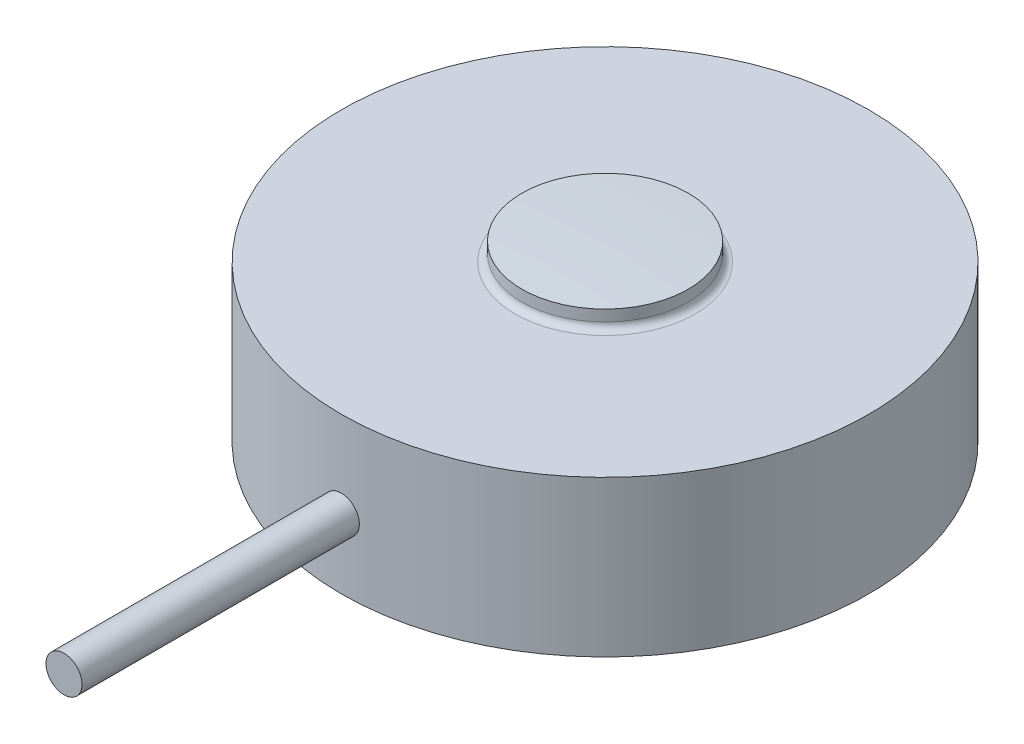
ISO-10303-21;
HEADER;
FILE_DESCRIPTION(('STEP AP214'),'2;1');
FILE_NAME('part.step','',(''),(''),'','','');
FILE_SCHEMA(('AUTOMOTIVE_DESIGN { 1 0 10303 214 1 1 1 1 }'));
ENDSEC;
DATA;
#1=APPLICATION_CONTEXT('core data for automotive mechanical design processes');
#2=APPLICATION_PROTOCOL_DEFINITION('international standard','automotive_design',2000,#1);
#3=PRODUCT_CONTEXT('',#1,'mechanical');
#4=PRODUCT('Part','Part','',(#3));
#5=PRODUCT_RELATED_PRODUCT_CATEGORY('part','',(#4));
#6=PRODUCT_DEFINITION_FORMATION('','',#4);
#7=PRODUCT_DEFINITION_CONTEXT('part definition',#1,'design');
#8=PRODUCT_DEFINITION('design','',#6,#7);
#9=PRODUCT_DEFINITION_SHAPE('','',#8);
#10=(LENGTH_UNIT() NAMED_UNIT(*) SI_UNIT(.MILLI.,.METRE.));
#11=(NAMED_UNIT(*) PLANE_ANGLE_UNIT() SI_UNIT($,.RADIAN.));
#12=(NAMED_UNIT(*) SI_UNIT($,.STERADIAN.) SOLID_ANGLE_UNIT());
#13=UNCERTAINTY_MEASURE_WITH_UNIT(LENGTH_MEASURE(1.E-05),#10,'distance_accuracy_value','');
#14=(GEOMETRIC_REPRESENTATION_CONTEXT(3) GLOBAL_UNCERTAINTY_ASSIGNED_CONTEXT((#13)) GLOBAL_UNIT_ASSIGNED_CONTEXT((#10,
#11,#12)) REPRESENTATION_CONTEXT('',''));
#15=CARTESIAN_POINT('',(0.,0.,0.));
#16=DIRECTION('',(0.,0.,1.));
#17=DIRECTION('',(1.,0.,0.));
#18=AXIS2_PLACEMENT_3D('',#15,#16,#17);
#19=CARTESIAN_POINT('',(0.,0.344999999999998,9.51));
#20=DIRECTION('',(0.,0.,1.));
#21=DIRECTION('',(1.,0.,0.));
#22=AXIS2_PLACEMENT_3D('',#19,#20,#21);
#23=PLANE('',#22);
#24=CARTESIAN_POINT('',(0.,-0.305000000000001,9.51));
#25=DIRECTION('',(0.,0.,1.));
#26=DIRECTION('',(1.,0.,0.));
#27=AXIS2_PLACEMENT_3D('',#24,#25,#26);
#28=CIRCLE('',#27,0.65);
#29=CARTESIAN_POINT('',(0.65,-0.305000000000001,9.51));
#30=VERTEX_POINT('',#29);
#31=EDGE_CURVE('E55',#30,#30,#28,.T.);
#32=ORIENTED_EDGE('',*,*,#31,.F.);
#33=EDGE_LOOP('',(#32));
#34=FACE_BOUND('',#33,.T.);
#35=ADVANCED_FACE('F49',(#34),#23,.F.);
#36=CARTESIAN_POINT('',(0.,-0.305000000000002,19.51));
#37=DIRECTION('',(0.,0.,-1.));
#38=DIRECTION('',(-1.,0.,0.));
#39=AXIS2_PLACEMENT_3D('',#36,#37,#38);
#40=PLANE('',#39);
#41=CARTESIAN_POINT('',(0.,-0.305000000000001,19.51));
#42=DIRECTION('',(0.,0.,1.));
#43=DIRECTION('',(1.,0.,0.));
#44=AXIS2_PLACEMENT_3D('',#41,#42,#43);
#45=CIRCLE('',#44,0.65);
#46=CARTESIAN_POINT('',(0.65,-0.305000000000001,19.51));
#47=VERTEX_POINT('',#46);
#48=EDGE_CURVE('E11',#47,#47,#45,.T.);
#49=ORIENTED_EDGE('',*,*,#48,.T.);
#50=EDGE_LOOP('',(#49));
#51=FACE_BOUND('',#50,.T.);
#52=ADVANCED_FACE('F64',(#51),#40,.F.);
#53=CARTESIAN_POINT('',(0.,-0.305000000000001,9.51));
#54=DIRECTION('',(0.,0.,1.));
#55=DIRECTION('',(1.,0.,0.));
#56=AXIS2_PLACEMENT_3D('',#53,#54,#55);
#57=CYLINDRICAL_SURFACE('',#56,0.65);
#58=ORIENTED_EDGE('',*,*,#48,.F.);
#59=EDGE_LOOP('',(#58));
#60=FACE_BOUND('',#59,.T.);
#61=ORIENTED_EDGE('',*,*,#31,.T.);
#62=EDGE_LOOP('',(#61));
#63=FACE_BOUND('',#62,.T.);
#64=ADVANCED_FACE('F61',(#60,#63),#57,.T.);
#65=CLOSED_SHELL('',(#35,#52,#64));
#66=MANIFOLD_SOLID_BREP('B2',#65);
#67=CARTESIAN_POINT('',(0.,2.805,9.51));
#68=DIRECTION('',(0.,-1.,0.));
#69=DIRECTION('',(0.,0.,-1.));
#70=AXIS2_PLACEMENT_3D('',#67,#68,#69);
#71=PLANE('',#70);
#72=CARTESIAN_POINT('',(0.,2.805,0.));
#73=DIRECTION('',(0.,-1.,0.));
#74=DIRECTION('',(0.,0.,-1.));
#75=AXIS2_PLACEMENT_3D('',#72,#73,#74);
#76=CIRCLE('',#75,3.25);
#77=CARTESIAN_POINT('',(0.,2.805,-3.25));
#78=VERTEX_POINT('',#77);
#79=EDGE_CURVE('E103',#78,#78,#76,.T.);
#80=ORIENTED_EDGE('',*,*,#79,.T.);
#81=EDGE_LOOP('',(#80));
#82=FACE_BOUND('',#81,.T.);
#83=CARTESIAN_POINT('',(0.,2.805,0.));
#84=DIRECTION('',(0.,-1.,0.));
#85=DIRECTION('',(0.,0.,-1.));
#86=AXIS2_PLACEMENT_3D('',#83,#84,#85);
#87=CIRCLE('',#86,9.51);
#88=CARTESIAN_POINT('',(0.,2.805,-9.51));
#89=VERTEX_POINT('',#88);
#90=EDGE_CURVE('E107',#89,#89,#87,.T.);
#91=ORIENTED_EDGE('',*,*,#90,.F.);
#92=EDGE_LOOP('',(#91));
#93=FACE_BOUND('',#92,.T.);
#94=ADVANCED_FACE('F96',(#82,#93),#71,.F.);
#95=CARTESIAN_POINT('',(0.,-50.,0.));
#96=DIRECTION('',(0.,-1.,0.));
#97=DIRECTION('',(0.,0.,-1.));
#98=AXIS2_PLACEMENT_3D('',#95,#96,#97);
#99=CYLINDRICAL_SURFACE('',#98,9.51);
#100=CARTESIAN_POINT('',(0.,-2.805,0.));
#101=DIRECTION('',(0.,-1.,0.));
#102=DIRECTION('',(0.,0.,-1.));
#103=AXIS2_PLACEMENT_3D('',#100,#101,#102);
#104=CIRCLE('',#103,9.51);
#105=CARTESIAN_POINT('',(0.,-2.805,-9.51));
#106=VERTEX_POINT('',#105);
#107=EDGE_CURVE('E111',#106,#106,#104,.T.);
#108=ORIENTED_EDGE('',*,*,#107,.F.);
#109=EDGE_LOOP('',(#108));
#110=FACE_BOUND('',#109,.T.);
#111=ORIENTED_EDGE('',*,*,#90,.T.);
#112=EDGE_LOOP('',(#111));
#113=FACE_BOUND('',#112,.T.);
#114=ADVANCED_FACE('F139',(#110,#113),#99,.T.);
#115=CARTESIAN_POINT('',(0.,-2.805,0.));
#116=DIRECTION('',(0.,1.,0.));
#117=DIRECTION('',(0.,0.,1.));
#118=AXIS2_PLACEMENT_3D('',#115,#116,#117);
#119=PLANE('',#118);
#120=CARTESIAN_POINT('',(0.,-2.805,0.));
#121=DIRECTION('',(0.,-1.,0.));
#122=DIRECTION('',(0.,0.,-1.));
#123=AXIS2_PLACEMENT_3D('',#120,#121,#122);
#124=CIRCLE('',#123,8.36);
#125=CARTESIAN_POINT('',(0.,-2.805,-8.36));
#126=VERTEX_POINT('',#125);
#127=EDGE_CURVE('E120',#126,#126,#124,.T.);
#128=ORIENTED_EDGE('',*,*,#127,.F.);
#129=EDGE_LOOP('',(#128));
#130=FACE_BOUND('',#129,.T.);
#131=ORIENTED_EDGE('',*,*,#107,.T.);
#132=EDGE_LOOP('',(#131));
#133=FACE_BOUND('',#132,.T.);
#134=ADVANCED_FACE('F135',(#130,#133),#119,.F.);
#135=CARTESIAN_POINT('',(0.,-46.955,0.));
#136=DIRECTION('',(0.,-1.,0.));
#137=DIRECTION('',(0.,0.,-1.));
#138=AXIS2_PLACEMENT_3D('',#135,#136,#137);
#139=SPHERICAL_SURFACE('',#138,50.5);
#140=CARTESIAN_POINT('',(0.,3.45581233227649,0.));
#141=DIRECTION('',(0.,-1.,0.));
#142=DIRECTION('',(0.,0.,-1.));
#143=AXIS2_PLACEMENT_3D('',#140,#141,#142);
#144=CIRCLE('',#143,3.);
#145=CARTESIAN_POINT('',(0.,3.45581233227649,-3.));
#146=VERTEX_POINT('',#145);
#147=EDGE_CURVE('E116',#146,#146,#144,.T.);
#148=ORIENTED_EDGE('',*,*,#147,.F.);
#149=EDGE_LOOP('',(#148));
#150=FACE_BOUND('',#149,.T.);
#151=ADVANCED_FACE('F138',(#150),#139,.T.);
#152=CARTESIAN_POINT('',(0.,-50.,0.));
#153=DIRECTION('',(0.,-1.,0.));
#154=DIRECTION('',(0.,0.,-1.));
#155=AXIS2_PLACEMENT_3D('',#152,#153,#154);
#156=CYLINDRICAL_SURFACE('',#155,3.);
#157=CARTESIAN_POINT('',(0.,3.055,0.));
#158=DIRECTION('',(0.,-1.,0.));
#159=DIRECTION('',(0.,0.,-1.));
#160=AXIS2_PLACEMENT_3D('',#157,#158,#159);
#161=CIRCLE('',#160,3.);
#162=CARTESIAN_POINT('',(0.,3.055,-3.));
#163=VERTEX_POINT('',#162);
#164=EDGE_CURVE('E48',#163,#163,#161,.F.);
#165=ORIENTED_EDGE('',*,*,#164,.T.);
#166=EDGE_LOOP('',(#165));
#167=FACE_BOUND('',#166,.T.);
#168=ORIENTED_EDGE('',*,*,#147,.T.);
#169=EDGE_LOOP('',(#168));
#170=FACE_BOUND('',#169,.T.);
#171=ADVANCED_FACE('F131',(#167,#170),#156,.T.);
#172=CARTESIAN_POINT('',(0.,-2.005,0.));
#173=DIRECTION('',(0.,-1.,0.));
#174=DIRECTION('',(0.,0.,-1.));
#175=AXIS2_PLACEMENT_3D('',#172,#173,#174);
#176=CYLINDRICAL_SURFACE('',#175,8.36);
#177=CARTESIAN_POINT('',(0.,-2.005,0.));
#178=DIRECTION('',(0.,-1.,0.));
#179=DIRECTION('',(0.,0.,-1.));
#180=AXIS2_PLACEMENT_3D('',#177,#178,#179);
#181=CIRCLE('',#180,8.36);
#182=CARTESIAN_POINT('',(0.,-2.005,-8.36));
#183=VERTEX_POINT('',#182);
#184=EDGE_CURVE('E119',#183,#183,#181,.T.);
#185=ORIENTED_EDGE('',*,*,#184,.F.);
#186=EDGE_LOOP('',(#185));
#187=FACE_BOUND('',#186,.T.);
#188=ORIENTED_EDGE('',*,*,#127,.T.);
#189=EDGE_LOOP('',(#188));
#190=FACE_BOUND('',#189,.T.);
#191=ADVANCED_FACE('F128',(#187,#190),#176,.F.);
#192=CARTESIAN_POINT('',(0.,-2.005,0.));
#193=DIRECTION('',(0.,-1.,0.));
#194=DIRECTION('',(0.,0.,-1.));
#195=AXIS2_PLACEMENT_3D('',#192,#193,#194);
#196=PLANE('',#195);
#197=ORIENTED_EDGE('',*,*,#184,.T.);
#198=EDGE_LOOP('',(#197));
#199=FACE_BOUND('',#198,.T.);
#200=ADVANCED_FACE('F126',(#199),#196,.T.);
#201=CARTESIAN_POINT('',(0.,3.055,0.));
#202=DIRECTION('',(0.,-1.,0.));
#203=DIRECTION('',(0.,0.,-1.));
#204=AXIS2_PLACEMENT_3D('',#201,#202,#203);
#205=TOROIDAL_SURFACE('',#204,3.25,0.25);
#206=ORIENTED_EDGE('',*,*,#164,.F.);
#207=EDGE_LOOP('',(#206));
#208=FACE_BOUND('',#207,.T.);
#209=ORIENTED_EDGE('',*,*,#79,.F.);
#210=EDGE_LOOP('',(#209));
#211=FACE_BOUND('',#210,.T.);
#212=ADVANCED_FACE('F98',(#208,#211),#205,.F.);
#213=CLOSED_SHELL('',(#94,#114,#134,#151,#171,#191,#200,#212));
#214=MANIFOLD_SOLID_BREP('B6',#213);
#215=ADVANCED_BREP_SHAPE_REPRESENTATION('',(#18,#66,#214),#14);
#216=SHAPE_DEFINITION_REPRESENTATION(#9,#215);
ENDSEC;
END-ISO-10303-21;
